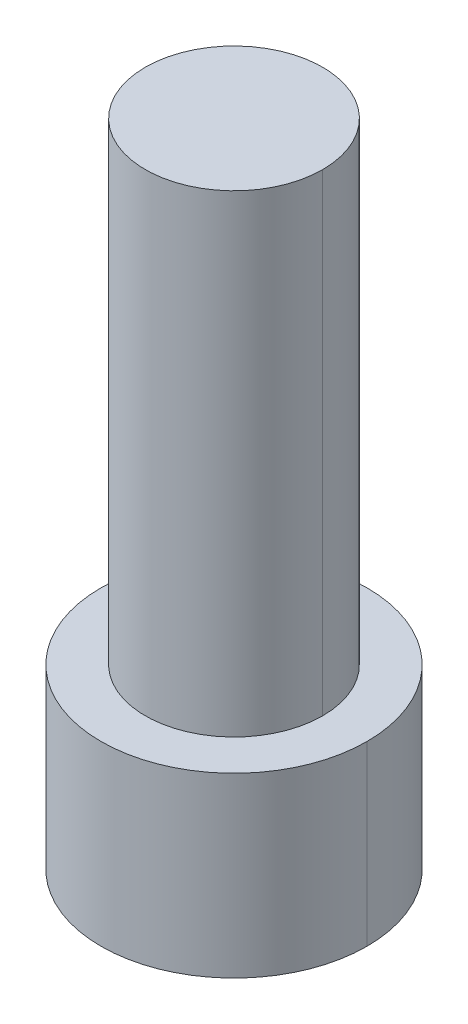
ISO-10303-21;
HEADER;
FILE_DESCRIPTION(('STEP AP214'),'2;1');
FILE_NAME('part.step','',(''),(''),'','','');
FILE_SCHEMA(('AUTOMOTIVE_DESIGN { 1 0 10303 214 1 1 1 1 }'));
ENDSEC;
DATA;
#1=APPLICATION_CONTEXT('core data for automotive mechanical design processes');
#2=APPLICATION_PROTOCOL_DEFINITION('international standard','automotive_design',2000,#1);
#3=PRODUCT_CONTEXT('',#1,'mechanical');
#4=PRODUCT('Part','Part','',(#3));
#5=PRODUCT_RELATED_PRODUCT_CATEGORY('part','',(#4));
#6=PRODUCT_DEFINITION_FORMATION('','',#4);
#7=PRODUCT_DEFINITION_CONTEXT('part definition',#1,'design');
#8=PRODUCT_DEFINITION('design','',#6,#7);
#9=PRODUCT_DEFINITION_SHAPE('','',#8);
#10=(LENGTH_UNIT() NAMED_UNIT(*) SI_UNIT(.MILLI.,.METRE.));
#11=(NAMED_UNIT(*) PLANE_ANGLE_UNIT() SI_UNIT($,.RADIAN.));
#12=(NAMED_UNIT(*) SI_UNIT($,.STERADIAN.) SOLID_ANGLE_UNIT());
#13=UNCERTAINTY_MEASURE_WITH_UNIT(LENGTH_MEASURE(1.E-05),#10,'distance_accuracy_value','');
#14=(GEOMETRIC_REPRESENTATION_CONTEXT(3) GLOBAL_UNCERTAINTY_ASSIGNED_CONTEXT((#13)) GLOBAL_UNIT_ASSIGNED_CONTEXT((#10,
#11,#12)) REPRESENTATION_CONTEXT('',''));
#15=CARTESIAN_POINT('',(0.,0.,0.));
#16=DIRECTION('',(0.,0.,1.));
#17=DIRECTION('',(1.,0.,0.));
#18=AXIS2_PLACEMENT_3D('',#15,#16,#17);
#19=CARTESIAN_POINT('',(0.,-9.525,0.));
#20=DIRECTION('',(0.,1.,0.));
#21=DIRECTION('',(0.,0.,1.));
#22=AXIS2_PLACEMENT_3D('',#19,#20,#21);
#23=PLANE('',#22);
#24=DIRECTION('',(-0.500000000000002,0.,0.866025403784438));
#25=VECTOR('',#24,1.);
#26=CARTESIAN_POINT('',(-2.29135888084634,-9.525,-3.96875));
#27=LINE('',#26,#25);
#28=CARTESIAN_POINT('',(-4.58271776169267,-9.525,0.));
#29=VERTEX_POINT('',#28);
#30=CARTESIAN_POINT('',(-2.29135888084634,-9.525,-3.96875));
#31=VERTEX_POINT('',#30);
#32=EDGE_CURVE('E171',#29,#31,#27,.F.);
#33=ORIENTED_EDGE('',*,*,#32,.T.);
#34=DIRECTION('',(-1.,0.,0.));
#35=VECTOR('',#34,1.);
#36=CARTESIAN_POINT('',(2.29135888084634,-9.525,-3.96875));
#37=LINE('',#36,#35);
#38=CARTESIAN_POINT('',(2.29135888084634,-9.525,-3.96875));
#39=VERTEX_POINT('',#38);
#40=EDGE_CURVE('E175',#31,#39,#37,.F.);
#41=ORIENTED_EDGE('',*,*,#40,.T.);
#42=DIRECTION('',(-0.500000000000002,0.,-0.866025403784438));
#43=VECTOR('',#42,1.);
#44=CARTESIAN_POINT('',(4.58271776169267,-9.525,0.));
#45=LINE('',#44,#43);
#46=CARTESIAN_POINT('',(4.58271776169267,-9.525,0.));
#47=VERTEX_POINT('',#46);
#48=EDGE_CURVE('E99',#39,#47,#45,.F.);
#49=ORIENTED_EDGE('',*,*,#48,.T.);
#50=DIRECTION('',(0.500000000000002,0.,-0.866025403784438));
#51=VECTOR('',#50,1.);
#52=CARTESIAN_POINT('',(2.29135888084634,-9.525,3.96875));
#53=LINE('',#52,#51);
#54=CARTESIAN_POINT('',(2.29135888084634,-9.525,3.96875));
#55=VERTEX_POINT('',#54);
#56=EDGE_CURVE('E101',#47,#55,#53,.F.);
#57=ORIENTED_EDGE('',*,*,#56,.T.);
#58=DIRECTION('',(1.,0.,0.));
#59=VECTOR('',#58,1.);
#60=CARTESIAN_POINT('',(-2.29135888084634,-9.525,3.96875));
#61=LINE('',#60,#59);
#62=CARTESIAN_POINT('',(-2.29135888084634,-9.525,3.96875));
#63=VERTEX_POINT('',#62);
#64=EDGE_CURVE('E103',#55,#63,#61,.F.);
#65=ORIENTED_EDGE('',*,*,#64,.T.);
#66=DIRECTION('',(0.500000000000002,0.,0.866025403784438));
#67=VECTOR('',#66,1.);
#68=CARTESIAN_POINT('',(-4.58271776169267,-9.525,0.));
#69=LINE('',#68,#67);
#70=EDGE_CURVE('E166',#63,#29,#69,.F.);
#71=ORIENTED_EDGE('',*,*,#70,.T.);
#72=EDGE_LOOP('',(#33,#41,#49,#57,#65,#71));
#73=FACE_BOUND('',#72,.T.);
#74=ADVANCED_FACE('F16',(#73),#23,.F.);
#75=CARTESIAN_POINT('',(-2.29135888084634,-9.525,3.96875));
#76=DIRECTION('',(0.,0.,1.));
#77=DIRECTION('',(1.,0.,0.));
#78=AXIS2_PLACEMENT_3D('',#75,#76,#77);
#79=PLANE('',#78);
#80=DIRECTION('',(0.,1.,0.));
#81=VECTOR('',#80,1.);
#82=CARTESIAN_POINT('',(-2.29135888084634,-9.525,3.96875));
#83=LINE('',#82,#81);
#84=CARTESIAN_POINT('',(-2.29135888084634,-17.4625,3.96875));
#85=VERTEX_POINT('',#84);
#86=EDGE_CURVE('E114',#85,#63,#83,.T.);
#87=ORIENTED_EDGE('',*,*,#86,.T.);
#88=ORIENTED_EDGE('',*,*,#64,.F.);
#89=DIRECTION('',(0.,1.,0.));
#90=VECTOR('',#89,1.);
#91=CARTESIAN_POINT('',(2.29135888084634,-9.525,3.96875));
#92=LINE('',#91,#90);
#93=CARTESIAN_POINT('',(2.29135888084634,-17.4625,3.96875));
#94=VERTEX_POINT('',#93);
#95=EDGE_CURVE('E108',#55,#94,#92,.F.);
#96=ORIENTED_EDGE('',*,*,#95,.T.);
#97=DIRECTION('',(1.,0.,0.));
#98=VECTOR('',#97,1.);
#99=CARTESIAN_POINT('',(0.,-17.4625,3.96875));
#100=LINE('',#99,#98);
#101=EDGE_CURVE('E163',#85,#94,#100,.T.);
#102=ORIENTED_EDGE('',*,*,#101,.F.);
#103=EDGE_LOOP('',(#87,#88,#96,#102));
#104=FACE_BOUND('',#103,.T.);
#105=ADVANCED_FACE('F111',(#104),#79,.F.);
#106=CARTESIAN_POINT('',(2.29135888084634,-9.525,3.96875));
#107=DIRECTION('',(0.866025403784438,0.,0.500000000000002));
#108=DIRECTION('',(0.500000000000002,0.,-0.866025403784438));
#109=AXIS2_PLACEMENT_3D('',#106,#107,#108);
#110=PLANE('',#109);
#111=ORIENTED_EDGE('',*,*,#95,.F.);
#112=ORIENTED_EDGE('',*,*,#56,.F.);
#113=DIRECTION('',(0.,1.,0.));
#114=VECTOR('',#113,1.);
#115=CARTESIAN_POINT('',(4.58271776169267,-9.525,0.));
#116=LINE('',#115,#114);
#117=CARTESIAN_POINT('',(4.58271776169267,-17.4625,0.));
#118=VERTEX_POINT('',#117);
#119=EDGE_CURVE('E122',#47,#118,#116,.F.);
#120=ORIENTED_EDGE('',*,*,#119,.T.);
#121=DIRECTION('',(0.500000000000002,0.,-0.866025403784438));
#122=VECTOR('',#121,1.);
#123=CARTESIAN_POINT('',(2.29135888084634,-17.4625,3.96875));
#124=LINE('',#123,#122);
#125=EDGE_CURVE('E119',#94,#118,#124,.T.);
#126=ORIENTED_EDGE('',*,*,#125,.F.);
#127=EDGE_LOOP('',(#111,#112,#120,#126));
#128=FACE_BOUND('',#127,.T.);
#129=ADVANCED_FACE('F117',(#128),#110,.F.);
#130=CARTESIAN_POINT('',(4.58271776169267,-9.525,0.));
#131=DIRECTION('',(0.866025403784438,0.,-0.500000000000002));
#132=DIRECTION('',(-0.500000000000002,0.,-0.866025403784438));
#133=AXIS2_PLACEMENT_3D('',#130,#131,#132);
#134=PLANE('',#133);
#135=ORIENTED_EDGE('',*,*,#119,.F.);
#136=ORIENTED_EDGE('',*,*,#48,.F.);
#137=DIRECTION('',(0.,1.,0.));
#138=VECTOR('',#137,1.);
#139=CARTESIAN_POINT('',(2.29135888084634,-9.525,-3.96875));
#140=LINE('',#139,#138);
#141=CARTESIAN_POINT('',(2.29135888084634,-17.4625,-3.96875));
#142=VERTEX_POINT('',#141);
#143=EDGE_CURVE('E173',#39,#142,#140,.F.);
#144=ORIENTED_EDGE('',*,*,#143,.T.);
#145=DIRECTION('',(-0.500000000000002,0.,-0.866025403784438));
#146=VECTOR('',#145,1.);
#147=CARTESIAN_POINT('',(4.58271776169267,-17.4625,0.));
#148=LINE('',#147,#146);
#149=EDGE_CURVE('E159',#118,#142,#148,.T.);
#150=ORIENTED_EDGE('',*,*,#149,.F.);
#151=EDGE_LOOP('',(#135,#136,#144,#150));
#152=FACE_BOUND('',#151,.T.);
#153=ADVANCED_FACE('F178',(#152),#134,.F.);
#154=CARTESIAN_POINT('',(2.29135888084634,-9.525,-3.96875));
#155=DIRECTION('',(0.,0.,-1.));
#156=DIRECTION('',(-1.,0.,0.));
#157=AXIS2_PLACEMENT_3D('',#154,#155,#156);
#158=PLANE('',#157);
#159=ORIENTED_EDGE('',*,*,#143,.F.);
#160=ORIENTED_EDGE('',*,*,#40,.F.);
#161=DIRECTION('',(0.,1.,0.));
#162=VECTOR('',#161,1.);
#163=CARTESIAN_POINT('',(-2.29135888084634,-9.525,-3.96875));
#164=LINE('',#163,#162);
#165=CARTESIAN_POINT('',(-2.29135888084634,-17.4625,-3.96875));
#166=VERTEX_POINT('',#165);
#167=EDGE_CURVE('E169',#31,#166,#164,.F.);
#168=ORIENTED_EDGE('',*,*,#167,.T.);
#169=DIRECTION('',(1.,0.,0.));
#170=VECTOR('',#169,1.);
#171=CARTESIAN_POINT('',(0.,-17.4625,-3.96875));
#172=LINE('',#171,#170);
#173=EDGE_CURVE('E156',#142,#166,#172,.F.);
#174=ORIENTED_EDGE('',*,*,#173,.F.);
#175=EDGE_LOOP('',(#159,#160,#168,#174));
#176=FACE_BOUND('',#175,.T.);
#177=ADVANCED_FACE('F189',(#176),#158,.F.);
#178=CARTESIAN_POINT('',(-2.29135888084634,-9.525,-3.96875));
#179=DIRECTION('',(-0.866025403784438,0.,-0.500000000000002));
#180=DIRECTION('',(-0.500000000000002,0.,0.866025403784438));
#181=AXIS2_PLACEMENT_3D('',#178,#179,#180);
#182=PLANE('',#181);
#183=ORIENTED_EDGE('',*,*,#167,.F.);
#184=ORIENTED_EDGE('',*,*,#32,.F.);
#185=DIRECTION('',(0.,1.,0.));
#186=VECTOR('',#185,1.);
#187=CARTESIAN_POINT('',(-4.58271776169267,-9.525,0.));
#188=LINE('',#187,#186);
#189=CARTESIAN_POINT('',(-4.58271776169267,-17.4625,0.));
#190=VERTEX_POINT('',#189);
#191=EDGE_CURVE('E66',#29,#190,#188,.F.);
#192=ORIENTED_EDGE('',*,*,#191,.T.);
#193=DIRECTION('',(-0.500000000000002,0.,0.866025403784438));
#194=VECTOR('',#193,1.);
#195=CARTESIAN_POINT('',(-2.29135888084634,-17.4625,-3.96875));
#196=LINE('',#195,#194);
#197=EDGE_CURVE('E153',#166,#190,#196,.T.);
#198=ORIENTED_EDGE('',*,*,#197,.F.);
#199=EDGE_LOOP('',(#183,#184,#192,#198));
#200=FACE_BOUND('',#199,.T.);
#201=ADVANCED_FACE('F187',(#200),#182,.F.);
#202=CARTESIAN_POINT('',(-4.58271776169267,-9.525,0.));
#203=DIRECTION('',(-0.866025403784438,0.,0.500000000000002));
#204=DIRECTION('',(0.500000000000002,0.,0.866025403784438));
#205=AXIS2_PLACEMENT_3D('',#202,#203,#204);
#206=PLANE('',#205);
#207=ORIENTED_EDGE('',*,*,#191,.F.);
#208=ORIENTED_EDGE('',*,*,#70,.F.);
#209=ORIENTED_EDGE('',*,*,#86,.F.);
#210=DIRECTION('',(0.500000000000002,0.,0.866025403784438));
#211=VECTOR('',#210,1.);
#212=CARTESIAN_POINT('',(-4.58271776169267,-17.4625,0.));
#213=LINE('',#212,#211);
#214=EDGE_CURVE('E150',#190,#85,#213,.T.);
#215=ORIENTED_EDGE('',*,*,#214,.F.);
#216=EDGE_LOOP('',(#207,#208,#209,#215));
#217=FACE_BOUND('',#216,.T.);
#218=ADVANCED_FACE('F184',(#217),#206,.F.);
#219=CARTESIAN_POINT('',(0.,-17.4625,0.));
#220=DIRECTION('',(0.,-1.,0.));
#221=DIRECTION('',(0.,0.,-1.));
#222=AXIS2_PLACEMENT_3D('',#219,#220,#221);
#223=PLANE('',#222);
#224=CARTESIAN_POINT('',(0.,-17.4625,0.));
#225=DIRECTION('',(0.,-1.,0.));
#226=DIRECTION('',(0.,0.,-1.));
#227=AXIS2_PLACEMENT_3D('',#224,#225,#226);
#228=CIRCLE('',#227,7.14375);
#229=CARTESIAN_POINT('',(-7.14375,-17.4625,0.));
#230=VERTEX_POINT('',#229);
#231=CARTESIAN_POINT('',(7.14375,-17.4625,0.));
#232=VERTEX_POINT('',#231);
#233=EDGE_CURVE('E138',#230,#232,#228,.F.);
#234=ORIENTED_EDGE('',*,*,#233,.F.);
#235=CARTESIAN_POINT('',(0.,-17.4625,0.));
#236=DIRECTION('',(0.,-1.,0.));
#237=DIRECTION('',(0.,0.,-1.));
#238=AXIS2_PLACEMENT_3D('',#235,#236,#237);
#239=CIRCLE('',#238,7.14375);
#240=EDGE_CURVE('E19',#232,#230,#239,.F.);
#241=ORIENTED_EDGE('',*,*,#240,.F.);
#242=EDGE_LOOP('',(#234,#241));
#243=FACE_BOUND('',#242,.T.);
#244=ORIENTED_EDGE('',*,*,#197,.T.);
#245=ORIENTED_EDGE('',*,*,#214,.T.);
#246=ORIENTED_EDGE('',*,*,#101,.T.);
#247=ORIENTED_EDGE('',*,*,#125,.T.);
#248=ORIENTED_EDGE('',*,*,#149,.T.);
#249=ORIENTED_EDGE('',*,*,#173,.T.);
#250=EDGE_LOOP('',(#244,#245,#246,#247,#248,#249));
#251=FACE_BOUND('',#250,.T.);
#252=ADVANCED_FACE('F182',(#243,#251),#223,.T.);
#253=CARTESIAN_POINT('',(0.,-12.7,0.));
#254=DIRECTION('',(0.,-1.,0.));
#255=DIRECTION('',(0.,0.,-1.));
#256=AXIS2_PLACEMENT_3D('',#253,#254,#255);
#257=CYLINDRICAL_SURFACE('',#256,7.14375);
#258=DIRECTION('',(0.,-1.,0.));
#259=VECTOR('',#258,1.);
#260=CARTESIAN_POINT('',(-7.14375,-12.7,0.));
#261=LINE('',#260,#259);
#262=CARTESIAN_POINT('',(-7.14375,-7.9375,0.));
#263=VERTEX_POINT('',#262);
#264=EDGE_CURVE('E140',#263,#230,#261,.T.);
#265=ORIENTED_EDGE('',*,*,#264,.F.);
#266=CARTESIAN_POINT('',(0.,-7.9375,0.));
#267=DIRECTION('',(0.,-1.,0.));
#268=DIRECTION('',(0.,0.,-1.));
#269=AXIS2_PLACEMENT_3D('',#266,#267,#268);
#270=CIRCLE('',#269,7.14375);
#271=CARTESIAN_POINT('',(7.14375,-7.9375,0.));
#272=VERTEX_POINT('',#271);
#273=EDGE_CURVE('E134',#272,#263,#270,.F.);
#274=ORIENTED_EDGE('',*,*,#273,.F.);
#275=DIRECTION('',(0.,-1.,0.));
#276=VECTOR('',#275,1.);
#277=CARTESIAN_POINT('',(7.14375,-12.7,0.));
#278=LINE('',#277,#276);
#279=EDGE_CURVE('E144',#232,#272,#278,.F.);
#280=ORIENTED_EDGE('',*,*,#279,.F.);
#281=ORIENTED_EDGE('',*,*,#240,.T.);
#282=EDGE_LOOP('',(#265,#274,#280,#281));
#283=FACE_BOUND('',#282,.T.);
#284=ADVANCED_FACE('F221',(#283),#257,.T.);
#285=CARTESIAN_POINT('',(0.,-12.7,0.));
#286=DIRECTION('',(0.,-1.,0.));
#287=DIRECTION('',(0.,0.,-1.));
#288=AXIS2_PLACEMENT_3D('',#285,#286,#287);
#289=CYLINDRICAL_SURFACE('',#288,7.14375);
#290=ORIENTED_EDGE('',*,*,#264,.T.);
#291=ORIENTED_EDGE('',*,*,#233,.T.);
#292=ORIENTED_EDGE('',*,*,#279,.T.);
#293=CARTESIAN_POINT('',(0.,-7.9375,0.));
#294=DIRECTION('',(0.,-1.,0.));
#295=DIRECTION('',(0.,0.,-1.));
#296=AXIS2_PLACEMENT_3D('',#293,#294,#295);
#297=CIRCLE('',#296,7.14375);
#298=EDGE_CURVE('E131',#263,#272,#297,.F.);
#299=ORIENTED_EDGE('',*,*,#298,.F.);
#300=EDGE_LOOP('',(#290,#291,#292,#299));
#301=FACE_BOUND('',#300,.T.);
#302=ADVANCED_FACE('F217',(#301),#289,.T.);
#303=CARTESIAN_POINT('',(0.,17.4625,0.));
#304=DIRECTION('',(0.,1.,0.));
#305=DIRECTION('',(0.,0.,1.));
#306=AXIS2_PLACEMENT_3D('',#303,#304,#305);
#307=PLANE('',#306);
#308=CARTESIAN_POINT('',(0.,17.4625,0.));
#309=DIRECTION('',(0.,-1.,0.));
#310=DIRECTION('',(0.,0.,-1.));
#311=AXIS2_PLACEMENT_3D('',#308,#309,#310);
#312=CIRCLE('',#311,4.7625);
#313=CARTESIAN_POINT('',(-4.7625,17.4625,0.));
#314=VERTEX_POINT('',#313);
#315=CARTESIAN_POINT('',(4.7625,17.4625,0.));
#316=VERTEX_POINT('',#315);
#317=EDGE_CURVE('E137',#314,#316,#312,.T.);
#318=ORIENTED_EDGE('',*,*,#317,.F.);
#319=CARTESIAN_POINT('',(0.,17.4625,0.));
#320=DIRECTION('',(0.,-1.,0.));
#321=DIRECTION('',(0.,0.,-1.));
#322=AXIS2_PLACEMENT_3D('',#319,#320,#321);
#323=CIRCLE('',#322,4.7625);
#324=EDGE_CURVE('E126',#316,#314,#323,.T.);
#325=ORIENTED_EDGE('',*,*,#324,.F.);
#326=EDGE_LOOP('',(#318,#325));
#327=FACE_BOUND('',#326,.T.);
#328=ADVANCED_FACE('F214',(#327),#307,.T.);
#329=CARTESIAN_POINT('',(0.,4.7625,0.));
#330=DIRECTION('',(0.,-1.,0.));
#331=DIRECTION('',(0.,0.,-1.));
#332=AXIS2_PLACEMENT_3D('',#329,#330,#331);
#333=CYLINDRICAL_SURFACE('',#332,4.7625);
#334=DIRECTION('',(0.,-1.,0.));
#335=VECTOR('',#334,1.);
#336=CARTESIAN_POINT('',(-4.7625,4.7625,0.));
#337=LINE('',#336,#335);
#338=CARTESIAN_POINT('',(-4.7625,-7.9375,0.));
#339=VERTEX_POINT('',#338);
#340=EDGE_CURVE('E25',#314,#339,#337,.T.);
#341=ORIENTED_EDGE('',*,*,#340,.F.);
#342=ORIENTED_EDGE('',*,*,#317,.T.);
#343=DIRECTION('',(0.,-1.,0.));
#344=VECTOR('',#343,1.);
#345=CARTESIAN_POINT('',(4.7625,4.7625,0.));
#346=LINE('',#345,#344);
#347=CARTESIAN_POINT('',(4.7625,-7.9375,0.));
#348=VERTEX_POINT('',#347);
#349=EDGE_CURVE('E129',#348,#316,#346,.F.);
#350=ORIENTED_EDGE('',*,*,#349,.F.);
#351=CARTESIAN_POINT('',(0.,-7.9375,0.));
#352=DIRECTION('',(0.,-1.,0.));
#353=DIRECTION('',(0.,0.,-1.));
#354=AXIS2_PLACEMENT_3D('',#351,#352,#353);
#355=CIRCLE('',#354,4.7625);
#356=EDGE_CURVE('E34',#339,#348,#355,.T.);
#357=ORIENTED_EDGE('',*,*,#356,.F.);
#358=EDGE_LOOP('',(#341,#342,#350,#357));
#359=FACE_BOUND('',#358,.T.);
#360=ADVANCED_FACE('F207',(#359),#333,.T.);
#361=CARTESIAN_POINT('',(0.,-7.9375,0.));
#362=DIRECTION('',(0.,1.,0.));
#363=DIRECTION('',(0.,0.,1.));
#364=AXIS2_PLACEMENT_3D('',#361,#362,#363);
#365=PLANE('',#364);
#366=CARTESIAN_POINT('',(0.,-7.9375,0.));
#367=DIRECTION('',(0.,-1.,0.));
#368=DIRECTION('',(0.,0.,-1.));
#369=AXIS2_PLACEMENT_3D('',#366,#367,#368);
#370=CIRCLE('',#369,4.7625);
#371=EDGE_CURVE('E11',#339,#348,#370,.F.);
#372=ORIENTED_EDGE('',*,*,#371,.F.);
#373=ORIENTED_EDGE('',*,*,#356,.T.);
#374=EDGE_LOOP('',(#372,#373));
#375=FACE_BOUND('',#374,.T.);
#376=ORIENTED_EDGE('',*,*,#273,.T.);
#377=ORIENTED_EDGE('',*,*,#298,.T.);
#378=EDGE_LOOP('',(#376,#377));
#379=FACE_BOUND('',#378,.T.);
#380=ADVANCED_FACE('F201',(#375,#379),#365,.T.);
#381=CARTESIAN_POINT('',(0.,4.7625,0.));
#382=DIRECTION('',(0.,-1.,0.));
#383=DIRECTION('',(0.,0.,-1.));
#384=AXIS2_PLACEMENT_3D('',#381,#382,#383);
#385=CYLINDRICAL_SURFACE('',#384,4.7625);
#386=ORIENTED_EDGE('',*,*,#340,.T.);
#387=ORIENTED_EDGE('',*,*,#371,.T.);
#388=ORIENTED_EDGE('',*,*,#349,.T.);
#389=ORIENTED_EDGE('',*,*,#324,.T.);
#390=EDGE_LOOP('',(#386,#387,#388,#389));
#391=FACE_BOUND('',#390,.T.);
#392=ADVANCED_FACE('F199',(#391),#385,.T.);
#393=CLOSED_SHELL('',(#74,#105,#129,#153,#177,#201,#218,#252,#284,#302,#328,#360,#380,#392));
#394=MANIFOLD_SOLID_BREP('B1',#393);
#395=ADVANCED_BREP_SHAPE_REPRESENTATION('',(#18,#394),#14);
#396=SHAPE_DEFINITION_REPRESENTATION(#9,#395);
ENDSEC;
END-ISO-10303-21;
